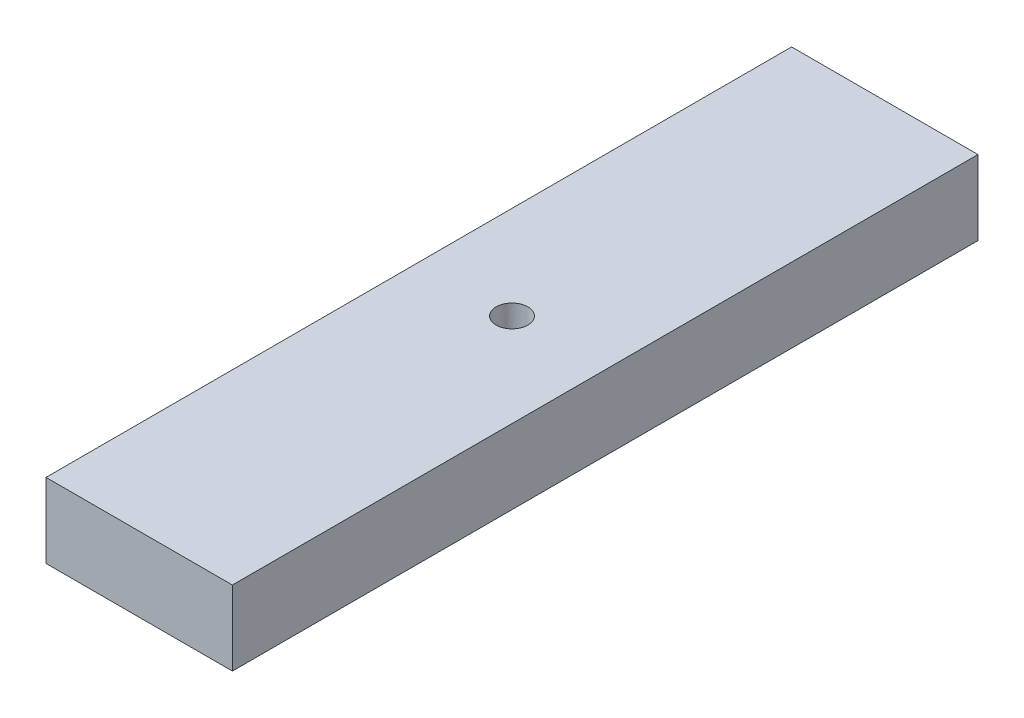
from build123d import *

# Parameters (mm, degrees)
EXTRUSION1_DEPTH      = 100
EXTRUSION1_DEPTH_BACK = 100
ESQUISSE1_W           = 50
ESQUISSE1_H           = 20
ESQUISSE2_R           = 4.25
EXTRUSION2_DEPTH      = 106


with BuildPart() as part:
    # Esquisse1 → Extrusion1 (new, two sides: drawn at the far end of the back side and taken through both)
    with BuildSketch(Plane.XY.offset(-EXTRUSION1_DEPTH_BACK)):
        with Locations((0, -10)):
            Rectangle(ESQUISSE1_W, ESQUISSE1_H)
    extrude(amount=EXTRUSION1_DEPTH + EXTRUSION1_DEPTH_BACK)

    # Esquisse2 → Extrusion2 (cut, through all)
    with BuildSketch(Plane(origin=(0, 0, 0), x_dir=(1, 0, 0), z_dir=(0, 1, 0))):
        with Locations(Location((0, 0, 0), (0, 0, 270))):
            Circle(ESQUISSE2_R)
    extrude(amount=-EXTRUSION2_DEPTH, mode=Mode.SUBTRACT)


solid = part.part
